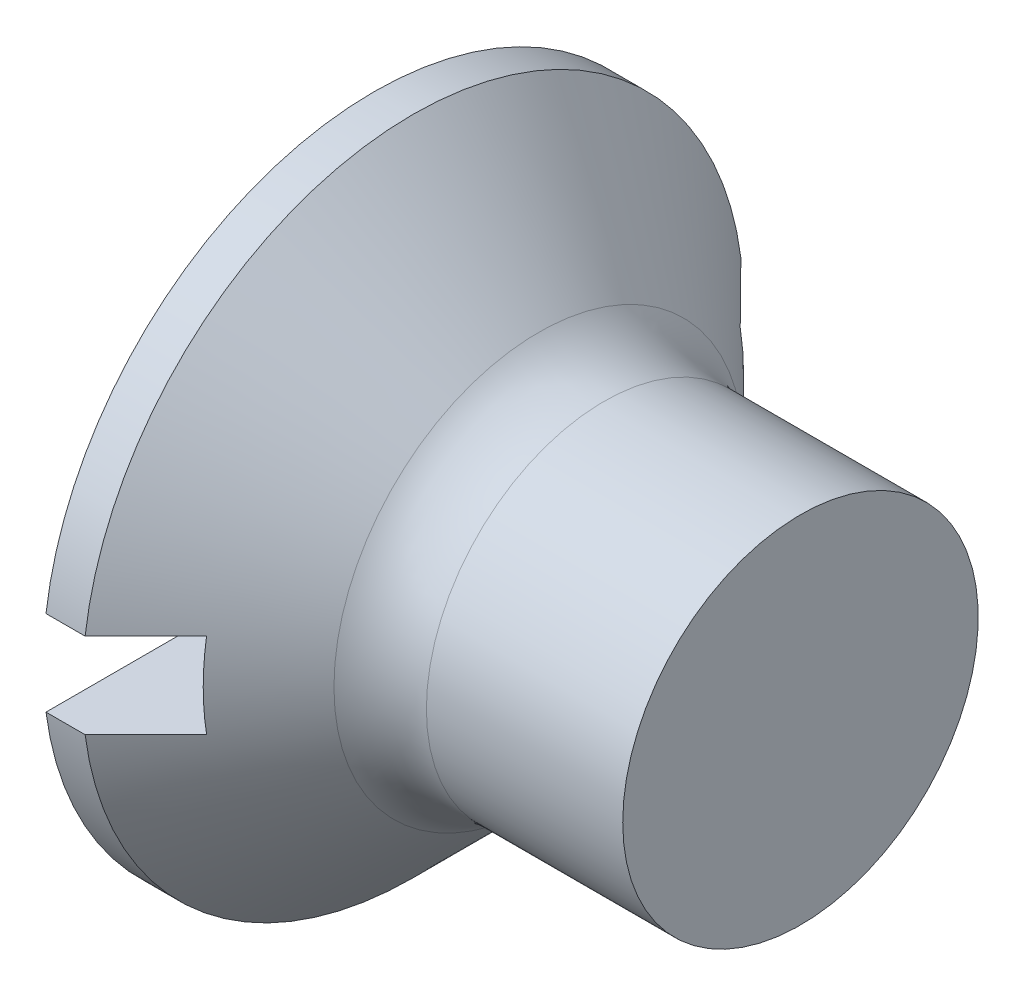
from build123d import *

# Parameters (mm, degrees)
FILLET1_R  = 1.3
SKETCH2_W  = 9.3
SKETCH2_H  = 1.2
SLOT_DEPTH = 1.4


with BuildPart() as part:
    # BodySke → Base-Revolve (revolve)
    with BuildSketch(Plane.XY, mode=Mode.PRIVATE) as base_revolve_sk:
        Polygon((0, 0), (0, 4.65), (0.55, 4.65), (2.7, 2.5), (6, 2.5), (6, 0), align=None)
    revolve(base_revolve_sk.sketch.rotate(Axis((-6.35, 0, 0), (1, 0, 0)), 90), axis=Axis((-6.35, 0, 0), (1, 0, 0)))

    # Fillet1
    fillet1_edges = [part.edges().sort_by_distance(p)[0] for p in [
        (2.7, 0, -2.5),
    ]]
    fillet(fillet1_edges, radius=FILLET1_R)

    # Sketch2 → Slot (cut)
    with BuildSketch(Plane.ZY):
        Rectangle(SKETCH2_W, SKETCH2_H)
    extrude(amount=-SLOT_DEPTH, mode=Mode.SUBTRACT)


solid = part.part
